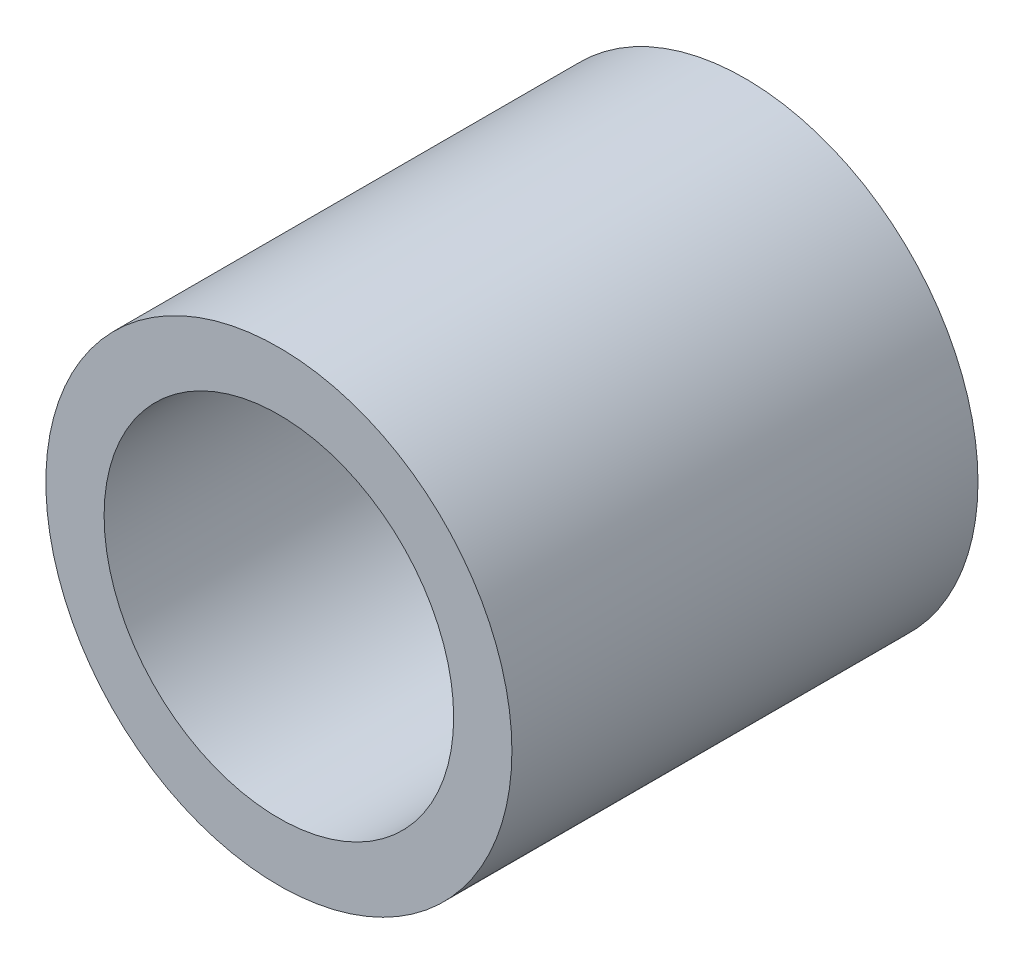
from build123d import *

# Parameters (mm, degrees)
ESQUISSE1_R          = 4
ESQUISSE1_R_2        = 3
BASE_EXTRUSION_DEPTH = 4


with BuildPart() as part:
    # Esquisse1 → Base-Extrusion (new, symmetric)
    with BuildSketch(Plane.XY):
        Circle(ESQUISSE1_R)
        Circle(ESQUISSE1_R_2, mode=Mode.SUBTRACT)
    extrude(amount=BASE_EXTRUSION_DEPTH, both=True)


solid = part.part
